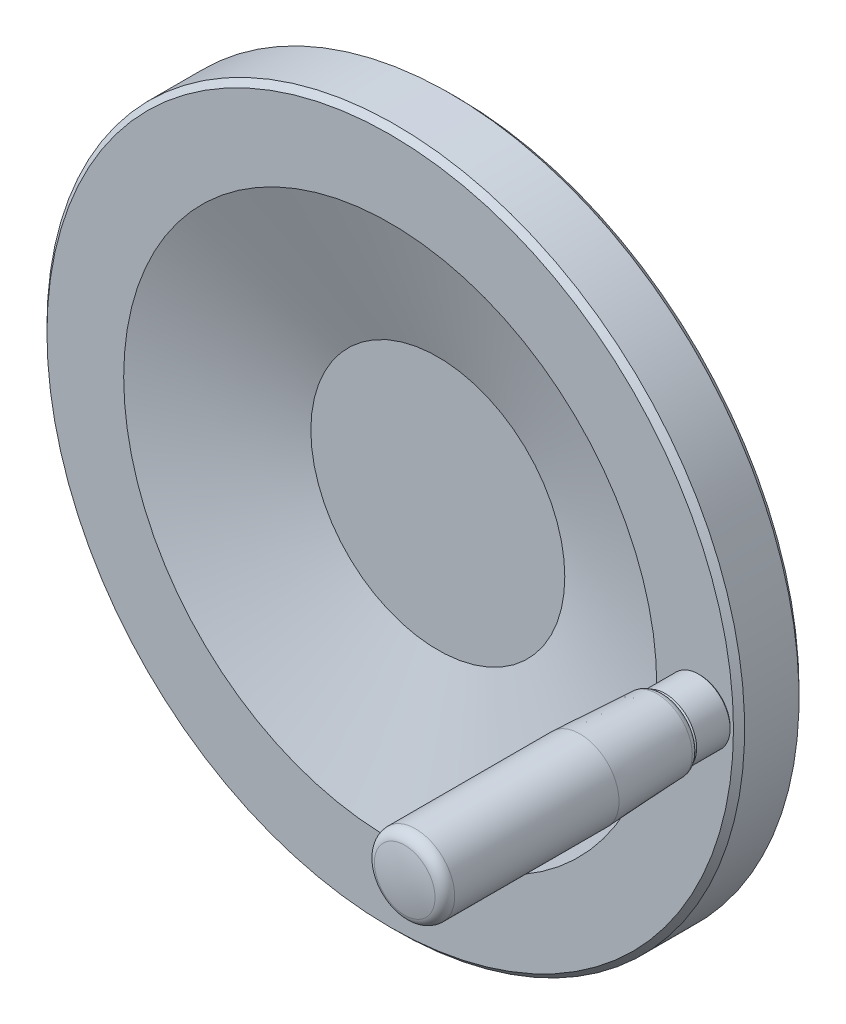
ISO-10303-21;
HEADER;
FILE_DESCRIPTION(('STEP AP214'),'2;1');
FILE_NAME('part.step','',(''),(''),'','','');
FILE_SCHEMA(('AUTOMOTIVE_DESIGN { 1 0 10303 214 1 1 1 1 }'));
ENDSEC;
DATA;
#1=APPLICATION_CONTEXT('core data for automotive mechanical design processes');
#2=APPLICATION_PROTOCOL_DEFINITION('international standard','automotive_design',2000,#1);
#3=PRODUCT_CONTEXT('',#1,'mechanical');
#4=PRODUCT('Part','Part','',(#3));
#5=PRODUCT_RELATED_PRODUCT_CATEGORY('part','',(#4));
#6=PRODUCT_DEFINITION_FORMATION('','',#4);
#7=PRODUCT_DEFINITION_CONTEXT('part definition',#1,'design');
#8=PRODUCT_DEFINITION('design','',#6,#7);
#9=PRODUCT_DEFINITION_SHAPE('','',#8);
#10=(LENGTH_UNIT() NAMED_UNIT(*) SI_UNIT(.MILLI.,.METRE.));
#11=(NAMED_UNIT(*) PLANE_ANGLE_UNIT() SI_UNIT($,.RADIAN.));
#12=(NAMED_UNIT(*) SI_UNIT($,.STERADIAN.) SOLID_ANGLE_UNIT());
#13=UNCERTAINTY_MEASURE_WITH_UNIT(LENGTH_MEASURE(1.E-05),#10,'distance_accuracy_value','');
#14=(GEOMETRIC_REPRESENTATION_CONTEXT(3) GLOBAL_UNCERTAINTY_ASSIGNED_CONTEXT((#13)) GLOBAL_UNIT_ASSIGNED_CONTEXT((#10,
#11,#12)) REPRESENTATION_CONTEXT('',''));
#15=CARTESIAN_POINT('',(0.,0.,0.));
#16=DIRECTION('',(0.,0.,1.));
#17=DIRECTION('',(1.,0.,0.));
#18=AXIS2_PLACEMENT_3D('',#15,#16,#17);
#19=CARTESIAN_POINT('',(0.,0.,62.));
#20=DIRECTION('',(0.,0.,-1.));
#21=DIRECTION('',(1.,0.,0.));
#22=AXIS2_PLACEMENT_3D('',#19,#20,#21);
#23=CONICAL_SURFACE('',#22,125.,0.785398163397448);
#24=CARTESIAN_POINT('',(0.,0.,64.));
#25=DIRECTION('',(0.,0.,1.));
#26=DIRECTION('',(-1.,0.,0.));
#27=AXIS2_PLACEMENT_3D('',#24,#25,#26);
#28=CIRCLE('',#27,123.);
#29=CARTESIAN_POINT('',(-123.,0.,64.0000000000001));
#30=VERTEX_POINT('',#29);
#31=EDGE_CURVE('E16',#30,#30,#28,.T.);
#32=ORIENTED_EDGE('',*,*,#31,.F.);
#33=EDGE_LOOP('',(#32));
#34=FACE_BOUND('',#33,.T.);
#35=CARTESIAN_POINT('',(0.,0.,62.));
#36=DIRECTION('',(0.,0.,1.));
#37=DIRECTION('',(-1.,0.,0.));
#38=AXIS2_PLACEMENT_3D('',#35,#36,#37);
#39=CIRCLE('',#38,125.);
#40=CARTESIAN_POINT('',(-125.,0.,62.0000000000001));
#41=VERTEX_POINT('',#40);
#42=EDGE_CURVE('E32',#41,#41,#39,.T.);
#43=ORIENTED_EDGE('',*,*,#42,.T.);
#44=EDGE_LOOP('',(#43));
#45=FACE_BOUND('',#44,.T.);
#46=ADVANCED_FACE('F13',(#34,#45),#23,.T.);
#47=CARTESIAN_POINT('',(95.5,0.,64.));
#48=DIRECTION('',(0.,0.,1.));
#49=DIRECTION('',(-1.,0.,0.));
#50=AXIS2_PLACEMENT_3D('',#47,#48,#49);
#51=PLANE('',#50);
#52=CARTESIAN_POINT('',(111.,0.,64.));
#53=DIRECTION('',(0.,0.,1.));
#54=DIRECTION('',(0.,-1.,0.));
#55=AXIS2_PLACEMENT_3D('',#52,#53,#54);
#56=CIRCLE('',#55,10.8039782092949);
#57=CARTESIAN_POINT('',(111.,-10.8039782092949,64.));
#58=VERTEX_POINT('',#57);
#59=EDGE_CURVE('E8',#58,#58,#56,.T.);
#60=ORIENTED_EDGE('',*,*,#59,.F.);
#61=EDGE_LOOP('',(#60));
#62=FACE_BOUND('',#61,.T.);
#63=ORIENTED_EDGE('',*,*,#31,.T.);
#64=EDGE_LOOP('',(#63));
#65=FACE_BOUND('',#64,.T.);
#66=CARTESIAN_POINT('',(0.,0.,64.));
#67=DIRECTION('',(0.,0.,1.));
#68=DIRECTION('',(-1.,0.,0.));
#69=AXIS2_PLACEMENT_3D('',#66,#67,#68);
#70=CIRCLE('',#69,95.5);
#71=CARTESIAN_POINT('',(-95.5,0.,64.0000000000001));
#72=VERTEX_POINT('',#71);
#73=EDGE_CURVE('E27',#72,#72,#70,.T.);
#74=ORIENTED_EDGE('',*,*,#73,.F.);
#75=EDGE_LOOP('',(#74));
#76=FACE_BOUND('',#75,.T.);
#77=ADVANCED_FACE('F82',(#62,#65,#76),#51,.T.);
#78=CARTESIAN_POINT('',(0.,0.,46.940239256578));
#79=DIRECTION('',(0.,0.,1.));
#80=DIRECTION('',(-1.,0.,0.));
#81=AXIS2_PLACEMENT_3D('',#78,#79,#80);
#82=CONICAL_SURFACE('',#81,45.5,1.24198684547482);
#83=ORIENTED_EDGE('',*,*,#73,.T.);
#84=EDGE_LOOP('',(#83));
#85=FACE_BOUND('',#84,.T.);
#86=CARTESIAN_POINT('',(0.,0.,46.940239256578));
#87=DIRECTION('',(0.,0.,1.));
#88=DIRECTION('',(-1.,0.,0.));
#89=AXIS2_PLACEMENT_3D('',#86,#87,#88);
#90=CIRCLE('',#89,45.5);
#91=CARTESIAN_POINT('',(-45.5,0.,46.940239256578));
#92=VERTEX_POINT('',#91);
#93=EDGE_CURVE('E72',#92,#92,#90,.T.);
#94=ORIENTED_EDGE('',*,*,#93,.F.);
#95=EDGE_LOOP('',(#94));
#96=FACE_BOUND('',#95,.T.);
#97=ADVANCED_FACE('F79',(#85,#96),#82,.F.);
#98=CARTESIAN_POINT('',(0.,0.,46.940239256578));
#99=DIRECTION('',(0.,0.,1.));
#100=DIRECTION('',(-1.,0.,0.));
#101=AXIS2_PLACEMENT_3D('',#98,#99,#100);
#102=PLANE('',#101);
#103=ORIENTED_EDGE('',*,*,#93,.T.);
#104=EDGE_LOOP('',(#103));
#105=FACE_BOUND('',#104,.T.);
#106=ADVANCED_FACE('F91',(#105),#102,.T.);
#107=CARTESIAN_POINT('',(21.,0.,0.));
#108=DIRECTION('',(0.,0.,-1.));
#109=DIRECTION('',(1.,0.,0.));
#110=AXIS2_PLACEMENT_3D('',#107,#108,#109);
#111=PLANE('',#110);
#112=CARTESIAN_POINT('',(0.,0.,0.));
#113=DIRECTION('',(0.,0.,1.));
#114=DIRECTION('',(-1.,0.,0.));
#115=AXIS2_PLACEMENT_3D('',#112,#113,#114);
#116=CIRCLE('',#115,21.);
#117=CARTESIAN_POINT('',(-21.,0.,0.));
#118=VERTEX_POINT('',#117);
#119=EDGE_CURVE('E68',#118,#118,#116,.T.);
#120=ORIENTED_EDGE('',*,*,#119,.F.);
#121=EDGE_LOOP('',(#120));
#122=FACE_BOUND('',#121,.T.);
#123=ADVANCED_FACE('F98',(#122),#111,.T.);
#124=CARTESIAN_POINT('',(0.,0.,1.));
#125=DIRECTION('',(0.,0.,1.));
#126=DIRECTION('',(-1.,0.,0.));
#127=AXIS2_PLACEMENT_3D('',#124,#125,#126);
#128=CONICAL_SURFACE('',#127,22.,0.785398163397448);
#129=ORIENTED_EDGE('',*,*,#119,.T.);
#130=EDGE_LOOP('',(#129));
#131=FACE_BOUND('',#130,.T.);
#132=CARTESIAN_POINT('',(0.,0.,1.));
#133=DIRECTION('',(0.,0.,1.));
#134=DIRECTION('',(-1.,0.,0.));
#135=AXIS2_PLACEMENT_3D('',#132,#133,#134);
#136=CIRCLE('',#135,22.);
#137=CARTESIAN_POINT('',(-22.,0.,1.00000000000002));
#138=VERTEX_POINT('',#137);
#139=EDGE_CURVE('E64',#138,#138,#136,.T.);
#140=ORIENTED_EDGE('',*,*,#139,.F.);
#141=EDGE_LOOP('',(#140));
#142=FACE_BOUND('',#141,.T.);
#143=ADVANCED_FACE('F102',(#131,#142),#128,.T.);
#144=CARTESIAN_POINT('',(0.,0.,84.));
#145=DIRECTION('',(0.,0.,1.));
#146=DIRECTION('',(-1.,0.,0.));
#147=AXIS2_PLACEMENT_3D('',#144,#145,#146);
#148=CYLINDRICAL_SURFACE('',#147,22.);
#149=ORIENTED_EDGE('',*,*,#139,.T.);
#150=EDGE_LOOP('',(#149));
#151=FACE_BOUND('',#150,.T.);
#152=CARTESIAN_POINT('',(0.,0.,19.));
#153=DIRECTION('',(0.,0.,1.));
#154=DIRECTION('',(-1.,0.,0.));
#155=AXIS2_PLACEMENT_3D('',#152,#153,#154);
#156=CIRCLE('',#155,22.);
#157=CARTESIAN_POINT('',(-22.,0.,19.));
#158=VERTEX_POINT('',#157);
#159=EDGE_CURVE('E60',#158,#158,#156,.T.);
#160=ORIENTED_EDGE('',*,*,#159,.F.);
#161=EDGE_LOOP('',(#160));
#162=FACE_BOUND('',#161,.T.);
#163=ADVANCED_FACE('F106',(#151,#162),#148,.T.);
#164=CARTESIAN_POINT('',(27.5,0.,19.));
#165=DIRECTION('',(0.,0.,-1.));
#166=DIRECTION('',(1.,0.,0.));
#167=AXIS2_PLACEMENT_3D('',#164,#165,#166);
#168=PLANE('',#167);
#169=ORIENTED_EDGE('',*,*,#159,.T.);
#170=EDGE_LOOP('',(#169));
#171=FACE_BOUND('',#170,.T.);
#172=CARTESIAN_POINT('',(0.,0.,19.));
#173=DIRECTION('',(0.,0.,1.));
#174=DIRECTION('',(-1.,0.,0.));
#175=AXIS2_PLACEMENT_3D('',#172,#173,#174);
#176=CIRCLE('',#175,27.5);
#177=CARTESIAN_POINT('',(-27.5,0.,19.));
#178=VERTEX_POINT('',#177);
#179=EDGE_CURVE('E56',#178,#178,#176,.T.);
#180=ORIENTED_EDGE('',*,*,#179,.F.);
#181=EDGE_LOOP('',(#180));
#182=FACE_BOUND('',#181,.T.);
#183=ADVANCED_FACE('F110',(#171,#182),#168,.T.);
#184=CARTESIAN_POINT('',(0.,0.,84.));
#185=DIRECTION('',(0.,0.,1.));
#186=DIRECTION('',(-1.,0.,0.));
#187=AXIS2_PLACEMENT_3D('',#184,#185,#186);
#188=CYLINDRICAL_SURFACE('',#187,27.5);
#189=ORIENTED_EDGE('',*,*,#179,.T.);
#190=EDGE_LOOP('',(#189));
#191=FACE_BOUND('',#190,.T.);
#192=CARTESIAN_POINT('',(0.,0.,24.3655325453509));
#193=DIRECTION('',(0.,0.,1.));
#194=DIRECTION('',(-1.,0.,0.));
#195=AXIS2_PLACEMENT_3D('',#192,#193,#194);
#196=CIRCLE('',#195,27.5);
#197=CARTESIAN_POINT('',(-27.5,0.,24.3655325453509));
#198=VERTEX_POINT('',#197);
#199=EDGE_CURVE('E52',#198,#198,#196,.T.);
#200=ORIENTED_EDGE('',*,*,#199,.F.);
#201=EDGE_LOOP('',(#200));
#202=FACE_BOUND('',#201,.T.);
#203=ADVANCED_FACE('F114',(#191,#202),#188,.T.);
#204=CARTESIAN_POINT('',(0.,0.,24.3655325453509));
#205=DIRECTION('',(0.,0.,1.));
#206=DIRECTION('',(-1.,0.,0.));
#207=AXIS2_PLACEMENT_3D('',#204,#205,#206);
#208=TOROIDAL_SURFACE('',#207,31.5,4.);
#209=ORIENTED_EDGE('',*,*,#199,.T.);
#210=EDGE_LOOP('',(#209));
#211=FACE_BOUND('',#210,.T.);
#212=CARTESIAN_POINT('',(0.,0.,28.098914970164));
#213=DIRECTION('',(0.,0.,1.));
#214=DIRECTION('',(-1.,0.,0.));
#215=AXIS2_PLACEMENT_3D('',#212,#213,#214);
#216=CIRCLE('',#215,30.0640836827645);
#217=CARTESIAN_POINT('',(-30.0640836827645,0.,28.098914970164));
#218=VERTEX_POINT('',#217);
#219=EDGE_CURVE('E48',#218,#218,#216,.T.);
#220=ORIENTED_EDGE('',*,*,#219,.F.);
#221=EDGE_LOOP('',(#220));
#222=FACE_BOUND('',#221,.T.);
#223=ADVANCED_FACE('F118',(#211,#222),#208,.F.);
#224=CARTESIAN_POINT('',(0.,0.,28.098914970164));
#225=DIRECTION('',(0.,0.,1.));
#226=DIRECTION('',(-1.,0.,0.));
#227=AXIS2_PLACEMENT_3D('',#224,#225,#226);
#228=CONICAL_SURFACE('',#227,30.0640836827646,1.20362249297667);
#229=CARTESIAN_POINT('',(0.,0.,40.));
#230=DIRECTION('',(0.,0.,1.));
#231=DIRECTION('',(-1.,0.,0.));
#232=AXIS2_PLACEMENT_3D('',#229,#230,#231);
#233=CIRCLE('',#232,61.0069047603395);
#234=CARTESIAN_POINT('',(-61.0069047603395,0.,40.0000000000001));
#235=VERTEX_POINT('',#234);
#236=EDGE_CURVE('E44',#235,#235,#233,.T.);
#237=ORIENTED_EDGE('',*,*,#236,.F.);
#238=EDGE_LOOP('',(#237));
#239=FACE_BOUND('',#238,.T.);
#240=ORIENTED_EDGE('',*,*,#219,.T.);
#241=EDGE_LOOP('',(#240));
#242=FACE_BOUND('',#241,.T.);
#243=ADVANCED_FACE('F122',(#239,#242),#228,.T.);
#244=CARTESIAN_POINT('',(61.006904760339,0.,40.));
#245=DIRECTION('',(0.,0.,1.));
#246=DIRECTION('',(-1.,0.,0.));
#247=AXIS2_PLACEMENT_3D('',#244,#245,#246);
#248=PLANE('',#247);
#249=CARTESIAN_POINT('',(0.,0.,40.));
#250=DIRECTION('',(0.,0.,1.));
#251=DIRECTION('',(-1.,0.,0.));
#252=AXIS2_PLACEMENT_3D('',#249,#250,#251);
#253=CIRCLE('',#252,122.5);
#254=CARTESIAN_POINT('',(-122.5,0.,40.0000000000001));
#255=VERTEX_POINT('',#254);
#256=EDGE_CURVE('E40',#255,#255,#253,.T.);
#257=ORIENTED_EDGE('',*,*,#256,.F.);
#258=EDGE_LOOP('',(#257));
#259=FACE_BOUND('',#258,.T.);
#260=ORIENTED_EDGE('',*,*,#236,.T.);
#261=EDGE_LOOP('',(#260));
#262=FACE_BOUND('',#261,.T.);
#263=ADVANCED_FACE('F126',(#259,#262),#248,.F.);
#264=CARTESIAN_POINT('',(0.,0.,42.5));
#265=DIRECTION('',(0.,0.,1.));
#266=DIRECTION('',(-1.,0.,0.));
#267=AXIS2_PLACEMENT_3D('',#264,#265,#266);
#268=CONICAL_SURFACE('',#267,125.,0.785398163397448);
#269=ORIENTED_EDGE('',*,*,#256,.T.);
#270=EDGE_LOOP('',(#269));
#271=FACE_BOUND('',#270,.T.);
#272=CARTESIAN_POINT('',(0.,0.,42.5));
#273=DIRECTION('',(0.,0.,1.));
#274=DIRECTION('',(-1.,0.,0.));
#275=AXIS2_PLACEMENT_3D('',#272,#273,#274);
#276=CIRCLE('',#275,125.);
#277=CARTESIAN_POINT('',(-125.,0.,42.5000000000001));
#278=VERTEX_POINT('',#277);
#279=EDGE_CURVE('E36',#278,#278,#276,.T.);
#280=ORIENTED_EDGE('',*,*,#279,.F.);
#281=EDGE_LOOP('',(#280));
#282=FACE_BOUND('',#281,.T.);
#283=ADVANCED_FACE('F130',(#271,#282),#268,.T.);
#284=CARTESIAN_POINT('',(0.,0.,84.));
#285=DIRECTION('',(0.,0.,1.));
#286=DIRECTION('',(-1.,0.,0.));
#287=AXIS2_PLACEMENT_3D('',#284,#285,#286);
#288=CYLINDRICAL_SURFACE('',#287,125.);
#289=ORIENTED_EDGE('',*,*,#279,.T.);
#290=EDGE_LOOP('',(#289));
#291=FACE_BOUND('',#290,.T.);
#292=ORIENTED_EDGE('',*,*,#42,.F.);
#293=EDGE_LOOP('',(#292));
#294=FACE_BOUND('',#293,.T.);
#295=ADVANCED_FACE('F134',(#291,#294),#288,.T.);
#296=CARTESIAN_POINT('',(111.,0.,121.));
#297=DIRECTION('',(0.,-1.,0.));
#298=DIRECTION('',(0.,0.,-1.));
#299=AXIS2_PLACEMENT_3D('',#296,#297,#298);
#300=SPHERICAL_SURFACE('',#299,50.);
#301=CARTESIAN_POINT('',(111.,0.,121.));
#302=DIRECTION('',(0.,0.,1.));
#303=DIRECTION('',(0.,-1.,0.));
#304=AXIS2_PLACEMENT_3D('',#301,#302,#303);
#305=SPHERICAL_SURFACE('',#304,50.);
#306=CARTESIAN_POINT('',(111.,0.,169.804226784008));
#307=DIRECTION('',(0.,0.,1.));
#308=DIRECTION('',(0.,-1.,0.));
#309=AXIS2_PLACEMENT_3D('',#306,#307,#308);
#310=CIRCLE('',#309,10.8695652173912);
#311=CARTESIAN_POINT('',(111.,-10.8695652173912,169.804226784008));
#312=VERTEX_POINT('',#311);
#313=EDGE_CURVE('E179',#312,#312,#310,.T.);
#314=ORIENTED_EDGE('',*,*,#313,.T.);
#315=EDGE_LOOP('',(#314));
#316=FACE_BOUND('',#315,.T.);
#317=ADVANCED_FACE('F138',(#316),#305,.T.);
#318=CARTESIAN_POINT('',(111.,0.,64.5));
#319=DIRECTION('',(0.,0.,1.));
#320=DIRECTION('',(0.,-1.,0.));
#321=AXIS2_PLACEMENT_3D('',#318,#319,#320);
#322=CONICAL_SURFACE('',#321,11.303978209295,0.785398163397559);
#323=ORIENTED_EDGE('',*,*,#59,.T.);
#324=EDGE_LOOP('',(#323));
#325=FACE_BOUND('',#324,.T.);
#326=CARTESIAN_POINT('',(111.,0.,64.5));
#327=DIRECTION('',(0.,0.,1.));
#328=DIRECTION('',(0.,-1.,0.));
#329=AXIS2_PLACEMENT_3D('',#326,#327,#328);
#330=CIRCLE('',#329,11.303978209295);
#331=CARTESIAN_POINT('',(111.,-11.303978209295,64.5));
#332=VERTEX_POINT('',#331);
#333=EDGE_CURVE('E30',#332,#332,#330,.T.);
#334=ORIENTED_EDGE('',*,*,#333,.F.);
#335=EDGE_LOOP('',(#334));
#336=FACE_BOUND('',#335,.T.);
#337=ADVANCED_FACE('F142',(#325,#336),#322,.T.);
#338=CARTESIAN_POINT('',(111.,0.,191.));
#339=DIRECTION('',(0.,0.,1.));
#340=DIRECTION('',(0.,-1.,0.));
#341=AXIS2_PLACEMENT_3D('',#338,#339,#340);
#342=CYLINDRICAL_SURFACE('',#341,11.303978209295);
#343=CARTESIAN_POINT('',(111.,0.,76.5));
#344=DIRECTION('',(0.,0.,1.));
#345=DIRECTION('',(0.,-1.,0.));
#346=AXIS2_PLACEMENT_3D('',#343,#344,#345);
#347=CIRCLE('',#346,11.303978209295);
#348=CARTESIAN_POINT('',(111.,-11.303978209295,76.5));
#349=VERTEX_POINT('',#348);
#350=EDGE_CURVE('E204',#349,#349,#347,.T.);
#351=ORIENTED_EDGE('',*,*,#350,.F.);
#352=EDGE_LOOP('',(#351));
#353=FACE_BOUND('',#352,.T.);
#354=ORIENTED_EDGE('',*,*,#333,.T.);
#355=EDGE_LOOP('',(#354));
#356=FACE_BOUND('',#355,.T.);
#357=ADVANCED_FACE('F146',(#353,#356),#342,.T.);
#358=CARTESIAN_POINT('',(111.,0.,76.5));
#359=DIRECTION('',(0.,0.,-1.));
#360=DIRECTION('',(0.,1.,0.));
#361=AXIS2_PLACEMENT_3D('',#358,#359,#360);
#362=CONICAL_SURFACE('',#361,11.303978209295,0.785398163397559);
#363=CARTESIAN_POINT('',(111.,0.,77.));
#364=DIRECTION('',(0.,0.,1.));
#365=DIRECTION('',(0.,-1.,0.));
#366=AXIS2_PLACEMENT_3D('',#363,#364,#365);
#367=CIRCLE('',#366,10.8039782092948);
#368=CARTESIAN_POINT('',(111.,-10.8039782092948,77.));
#369=VERTEX_POINT('',#368);
#370=EDGE_CURVE('E201',#369,#369,#367,.T.);
#371=ORIENTED_EDGE('',*,*,#370,.F.);
#372=EDGE_LOOP('',(#371));
#373=FACE_BOUND('',#372,.T.);
#374=ORIENTED_EDGE('',*,*,#350,.T.);
#375=EDGE_LOOP('',(#374));
#376=FACE_BOUND('',#375,.T.);
#377=ADVANCED_FACE('F149',(#373,#376),#362,.T.);
#378=CARTESIAN_POINT('',(121.121876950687,0.,77.));
#379=DIRECTION('',(0.,0.,1.));
#380=DIRECTION('',(0.,-1.,0.));
#381=AXIS2_PLACEMENT_3D('',#378,#379,#380);
#382=PLANE('',#381);
#383=ORIENTED_EDGE('',*,*,#370,.T.);
#384=EDGE_LOOP('',(#383));
#385=FACE_BOUND('',#384,.T.);
#386=CARTESIAN_POINT('',(111.,0.,77.));
#387=DIRECTION('',(0.,0.,1.));
#388=DIRECTION('',(0.,-1.,0.));
#389=AXIS2_PLACEMENT_3D('',#386,#387,#388);
#390=CIRCLE('',#389,10.1218769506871);
#391=CARTESIAN_POINT('',(111.,-10.1218769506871,77.));
#392=VERTEX_POINT('',#391);
#393=EDGE_CURVE('E197',#392,#392,#390,.T.);
#394=ORIENTED_EDGE('',*,*,#393,.F.);
#395=EDGE_LOOP('',(#394));
#396=FACE_BOUND('',#395,.T.);
#397=ADVANCED_FACE('F153',(#385,#396),#382,.T.);
#398=CARTESIAN_POINT('',(111.,0.,79.5));
#399=DIRECTION('',(0.,0.,1.));
#400=DIRECTION('',(0.,-1.,0.));
#401=AXIS2_PLACEMENT_3D('',#398,#399,#400);
#402=TOROIDAL_SURFACE('',#401,10.1218769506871,2.49999999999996);
#403=CARTESIAN_POINT('',(111.,0.,79.37515595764));
#404=DIRECTION('',(0.,0.,1.));
#405=DIRECTION('',(0.,-1.,0.));
#406=AXIS2_PLACEMENT_3D('',#403,#404,#405);
#407=CIRCLE('',#406,12.6187577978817);
#408=CARTESIAN_POINT('',(111.,-12.6187577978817,79.37515595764));
#409=VERTEX_POINT('',#408);
#410=EDGE_CURVE('E190',#409,#409,#407,.T.);
#411=ORIENTED_EDGE('',*,*,#410,.F.);
#412=EDGE_LOOP('',(#411));
#413=FACE_BOUND('',#412,.T.);
#414=ORIENTED_EDGE('',*,*,#393,.T.);
#415=EDGE_LOOP('',(#414));
#416=FACE_BOUND('',#415,.T.);
#417=ADVANCED_FACE('F157',(#413,#416),#402,.T.);
#418=CARTESIAN_POINT('',(111.,0.,107.));
#419=DIRECTION('',(0.,0.,1.));
#420=DIRECTION('',(0.,-1.,0.));
#421=AXIS2_PLACEMENT_3D('',#418,#419,#420);
#422=CONICAL_SURFACE('',#421,14.,0.0499583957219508);
#423=ORIENTED_EDGE('',*,*,#410,.T.);
#424=EDGE_LOOP('',(#423));
#425=FACE_BOUND('',#424,.T.);
#426=CARTESIAN_POINT('',(111.,0.,107.));
#427=DIRECTION('',(0.,0.,1.));
#428=DIRECTION('',(0.,-1.,0.));
#429=AXIS2_PLACEMENT_3D('',#426,#427,#428);
#430=CIRCLE('',#429,14.);
#431=CARTESIAN_POINT('',(111.,-14.,107.));
#432=VERTEX_POINT('',#431);
#433=EDGE_CURVE('E185',#432,#432,#430,.T.);
#434=ORIENTED_EDGE('',*,*,#433,.F.);
#435=EDGE_LOOP('',(#434));
#436=FACE_BOUND('',#435,.T.);
#437=ADVANCED_FACE('F161',(#425,#436),#422,.T.);
#438=CARTESIAN_POINT('',(111.,0.,191.));
#439=DIRECTION('',(0.,0.,1.));
#440=DIRECTION('',(0.,-1.,0.));
#441=AXIS2_PLACEMENT_3D('',#438,#439,#440);
#442=CYLINDRICAL_SURFACE('',#441,14.);
#443=ORIENTED_EDGE('',*,*,#433,.T.);
#444=EDGE_LOOP('',(#443));
#445=FACE_BOUND('',#444,.T.);
#446=CARTESIAN_POINT('',(111.,0.,165.899888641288));
#447=DIRECTION('',(0.,0.,1.));
#448=DIRECTION('',(0.,-1.,0.));
#449=AXIS2_PLACEMENT_3D('',#446,#447,#448);
#450=CIRCLE('',#449,14.);
#451=CARTESIAN_POINT('',(111.,-14.,165.899888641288));
#452=VERTEX_POINT('',#451);
#453=EDGE_CURVE('E182',#452,#452,#450,.T.);
#454=ORIENTED_EDGE('',*,*,#453,.F.);
#455=EDGE_LOOP('',(#454));
#456=FACE_BOUND('',#455,.T.);
#457=ADVANCED_FACE('F165',(#445,#456),#442,.T.);
#458=CARTESIAN_POINT('',(111.,0.,165.899888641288));
#459=DIRECTION('',(0.,0.,1.));
#460=DIRECTION('',(0.,-1.,0.));
#461=AXIS2_PLACEMENT_3D('',#458,#459,#460);
#462=TOROIDAL_SURFACE('',#461,10.,4.);
#463=ORIENTED_EDGE('',*,*,#313,.F.);
#464=EDGE_LOOP('',(#463));
#465=FACE_BOUND('',#464,.T.);
#466=ORIENTED_EDGE('',*,*,#453,.T.);
#467=EDGE_LOOP('',(#466));
#468=FACE_BOUND('',#467,.T.);
#469=ADVANCED_FACE('F169',(#465,#468),#462,.T.);
#470=CLOSED_SHELL('',(#46,#77,#97,#106,#123,#143,#163,#183,#203,#223,#243,#263,#283,#295,#317,
#337,#357,#377,#397,#417,#437,#457,#469));
#471=MANIFOLD_SOLID_BREP('B1',#470);
#472=ADVANCED_BREP_SHAPE_REPRESENTATION('',(#18,#471),#14);
#473=SHAPE_DEFINITION_REPRESENTATION(#9,#472);
ENDSEC;
END-ISO-10303-21;
